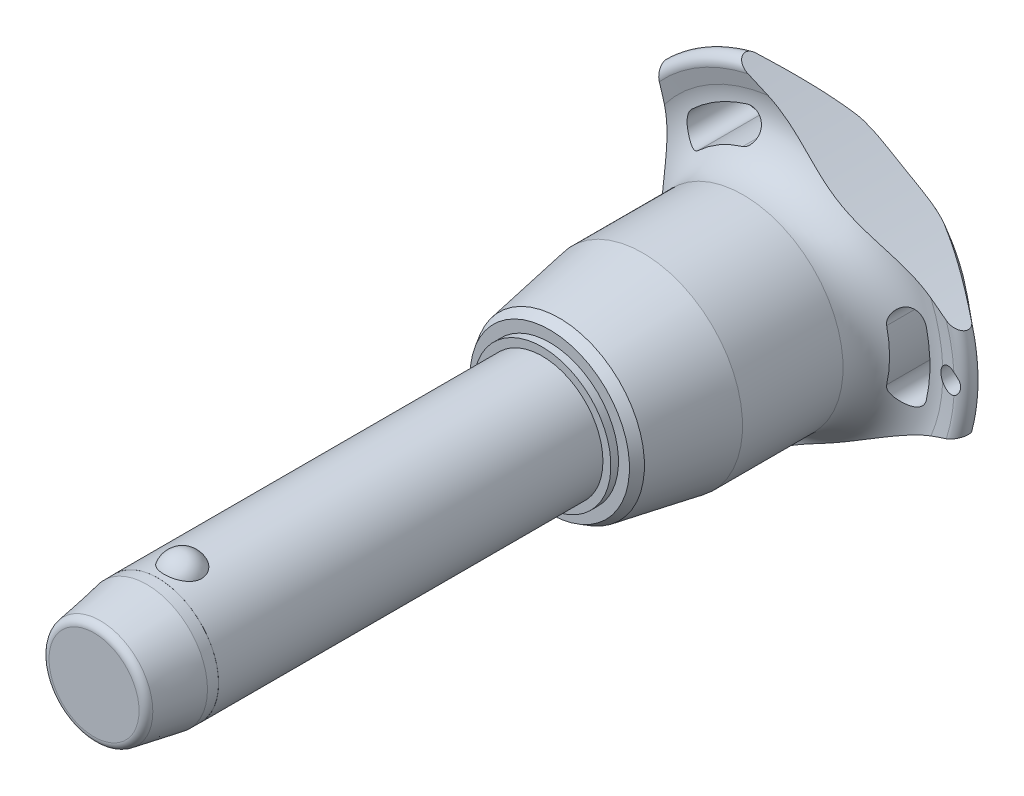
from build123d import *

# Parameters (mm, degrees)
SKETCH1_R           = 8
BOSS_EXTRUDE1_DEPTH = 45
SKETCH2_R           = 7
BOSS_EXTRUDE2_DEPTH = 39.7
BOSS_EXTRUDE3_START = 14
SKETCH1_2_R         = 8
BOSS_EXTRUDE3_DEPTH = 14
CHAMFER1_SIZE       = 7
CHAMFER1_SIZE2      = 1.234288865
FILLET1_R           = 1
SKETCH6_R           = 144.275
CUT_EXTRUDE1_DEPTH  = 92.145351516
CIRPATTERN1_COUNT   = 3
SKETCH7_R           = 1.5
CUT_EXTRUDE2_DEPTH  = 91.924898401
SKETCH8_R           = 8
SKETCH8_R_2         = 7.99
CUT_EXTRUDE3_DEPTH  = 8.4


with BuildPart() as part:
    # Sketch1 → Boss-Extrude1 (new body)
    with BuildSketch(Plane.XY):
        Circle(SKETCH1_R)
    extrude(amount=-BOSS_EXTRUDE1_DEPTH)

    # Sketch2 → Boss-Extrude2 (add)
    with BuildSketch(Plane(origin=(0, 0, -45), x_dir=(-1, 0, 0), z_dir=(0, 0, -1))):
        Circle(SKETCH2_R)
    extrude(amount=BOSS_EXTRUDE2_DEPTH)

    # Sketch3 → Revolve1 (revolve)
    with BuildSketch(Plane(origin=(0, 0, 0), x_dir=(0, 0, -1), z_dir=(1, 0, 0))):
        with BuildLine():
            Line((-2.387467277, 9.5), (-2.387467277, 4.2))
            ThreePointArc((-2.387467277, 4.2), (0.262532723, 6.85), (-2.387467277, 9.5))
        make_face()
        with BuildLine():
            Line((-2.387467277, -4.2), (-2.387467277, -9.5))
            ThreePointArc((-2.387467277, -9.5), (0.262532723, -6.85), (-2.387467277, -4.2))
        make_face()
    revolve(axis=Axis((0, -4.2, 2.387467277), (0, 1, 0)))

    # Sketch1_2 → Boss-Extrude3 (add)
    with BuildSketch(Plane.XY.offset(BOSS_EXTRUDE3_START)):
        Circle(SKETCH1_2_R)
    extrude(amount=-BOSS_EXTRUDE3_DEPTH)

    # Chamfer1
    chamfer1_edges = [part.edges().sort_by_distance(p)[0] for p in [
        (-8, 0, 14),
    ]]
    chamfer1_side = [part.faces().sort_by_distance(p)[0] for p in [
        (-8, 0, -15.5),
    ]]
    chamfer(chamfer1_edges, length=CHAMFER1_SIZE, length2=CHAMFER1_SIZE2, reference=chamfer1_side[0])

    # Fillet1
    fillet1_edges = [part.edges().sort_by_distance(p)[0] for p in [
        (-6.765711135, 0, 14),
        (7, 0, -84.7),
    ]]
    fillet(fillet1_edges, radius=FILLET1_R)

    # Sketch4 → Revolve2 (revolve)
    with BuildSketch(Plane(origin=(0, 0, 0), x_dir=(0, 0, -1), z_dir=(1, 0, 0)), mode=Mode.PRIVATE) as revolve2_sk:
        Polygon((45, 0), (45, 9.044607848), (46, 9.044607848), (46, 10.490707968), (47.25235944, 11.213758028), (58.233333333, 13.15), (71.466666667, 13.15), (71.466666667, 0), align=None)
    revolve(revolve2_sk.sketch.rotate(Axis((0, 0, -71.466666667), (0, 0, 1)), 90), axis=Axis((0, 0, -71.466666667), (0, 0, 1)))

    # Sketch5 → Revolve3 (revolve)
    with BuildSketch(Plane(origin=(0, 0, 0), x_dir=(0, 0, -1), z_dir=(1, 0, 0)), mode=Mode.PRIVATE) as revolve3_sk:
        with BuildLine():
            Line((77.32877039, 20.428960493), (76.910912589, 22.344207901))
            ThreePointArc((76.910912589, 22.344207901), (77.554394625, 23.677136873), (79.002586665, 23.371345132))
            Line((79.002586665, 23.371345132), (84.141488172, 17.247040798))
            ThreePointArc((84.141488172, 17.247040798), (84.7, 15.584758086), (83.978803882, 13.986322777))
            ThreePointArc((83.978803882, 13.986322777), (79.617427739, 7.589034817), (78.083333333, 0))
            Line((78.083333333, 0), (71.466666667, 0))
            Line((71.466666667, 0), (71.466666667, 13.15))
            ThreePointArc((71.466666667, 13.15), (76.139661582, 15.38660811), (77.32877039, 20.428960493))
        make_face()
    revolve(revolve3_sk.sketch.rotate(Axis((0, 0, -78.083333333), (0, 0, 1)), 90), axis=Axis((0, 0, -78.083333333), (0, 0, 1)))

    # Sketch6 → Cut-Extrude1 (cut, through all)
    with BuildSketch(Plane.XY):
        with Locations((-159.975, 0)):
            Circle(SKETCH6_R)
        with BuildLine():
            ThreePointArc((18.131206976, -4.190753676), (18.60922037, 0), (18.131206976, 4.190753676))
            ThreePointArc((18.131206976, 4.190753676), (15.94840906, 5.553949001), (14.585213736, 3.371151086))
            ThreePointArc((14.585213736, 3.371151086), (14.969740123, 0), (14.585213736, -3.371151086))
            ThreePointArc((14.585213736, -3.371151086), (15.94840906, -5.553949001), (18.131206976, -4.190753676))
        make_face()
    cut_extrude1 = extrude(amount=-CUT_EXTRUDE1_DEPTH, mode=Mode.SUBTRACT)

    # CirPattern1: Cut-Extrude1 ×3 about axis
    cirpattern1_axis = Axis((0, 0, 0), (0, 0, 1))
    for i in range(1, CIRPATTERN1_COUNT):
        add(cut_extrude1.rotate(cirpattern1_axis, i * 360 / CIRPATTERN1_COUNT), mode=Mode.SUBTRACT)

    # Sketch7 → Cut-Extrude2 (cut, through all)
    with BuildSketch(Plane.XY):
        with Locations(Location((21.60922037, 0, 0), (0, 0, 297.620773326))):
            Circle(SKETCH7_R)
    extrude(amount=-CUT_EXTRUDE2_DEPTH, mode=Mode.SUBTRACT)

    # Sketch8 → Cut-Extrude3 (cut)
    with BuildSketch(Plane.XY.offset(14)):
        Circle(SKETCH8_R)
        Circle(SKETCH8_R_2, mode=Mode.SUBTRACT)
    extrude(amount=-CUT_EXTRUDE3_DEPTH, mode=Mode.SUBTRACT)


solid = part.part
